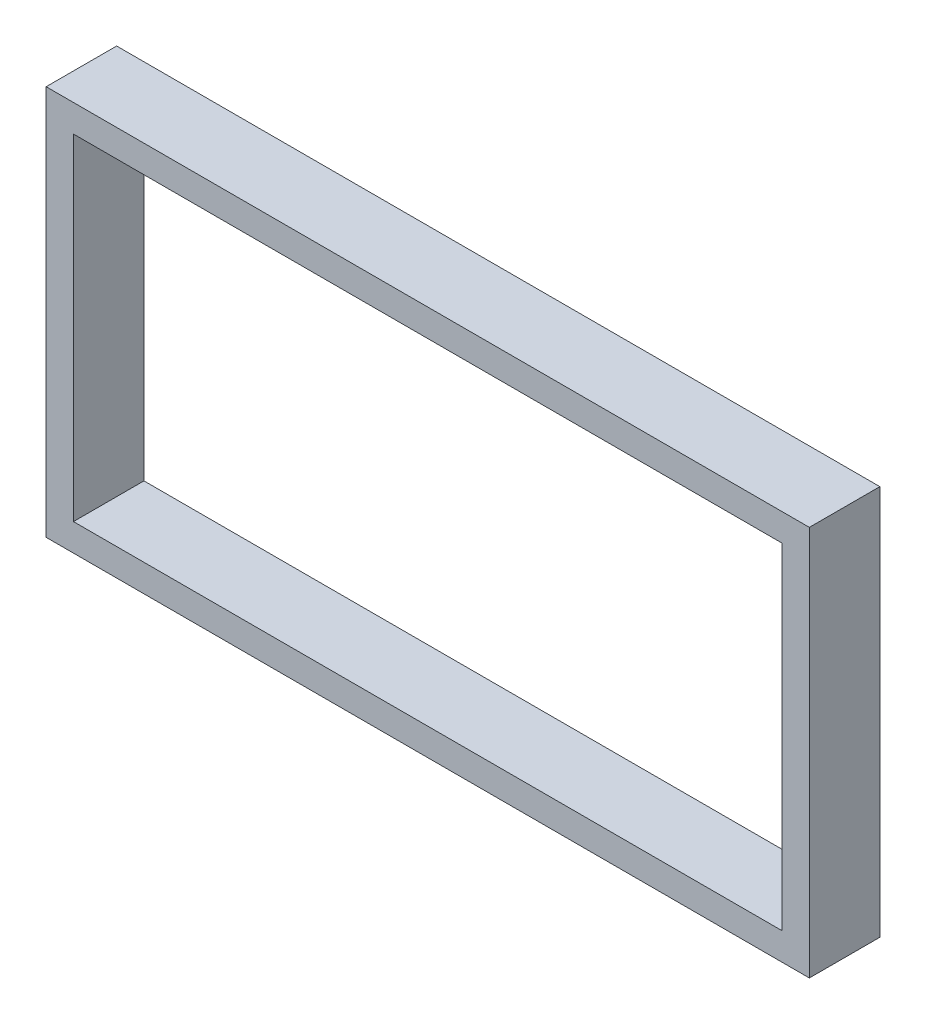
from build123d import *

# Parameters (mm, degrees)
SKETCH1_W           = 111.76
SKETCH1_H           = 57.15
BOSS_EXTRUDE1_DEPTH = 10.3251
SKETCH2_W           = 103.76
SKETCH2_H           = 49.15
CUT_EXTRUDE1_DEPTH  = 64.605917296


with BuildPart() as part:
    # Sketch1 → Boss-Extrude1 (new body)
    with BuildSketch(Plane.XY):
        Rectangle(SKETCH1_W, SKETCH1_H)
    extrude(amount=BOSS_EXTRUDE1_DEPTH)

    # Sketch2 → Cut-Extrude1 (cut, through all)
    with BuildSketch(Plane.XY.offset(10.3251)):
        Rectangle(SKETCH2_W, SKETCH2_H)
    extrude(amount=-CUT_EXTRUDE1_DEPTH, mode=Mode.SUBTRACT)


solid = part.part
